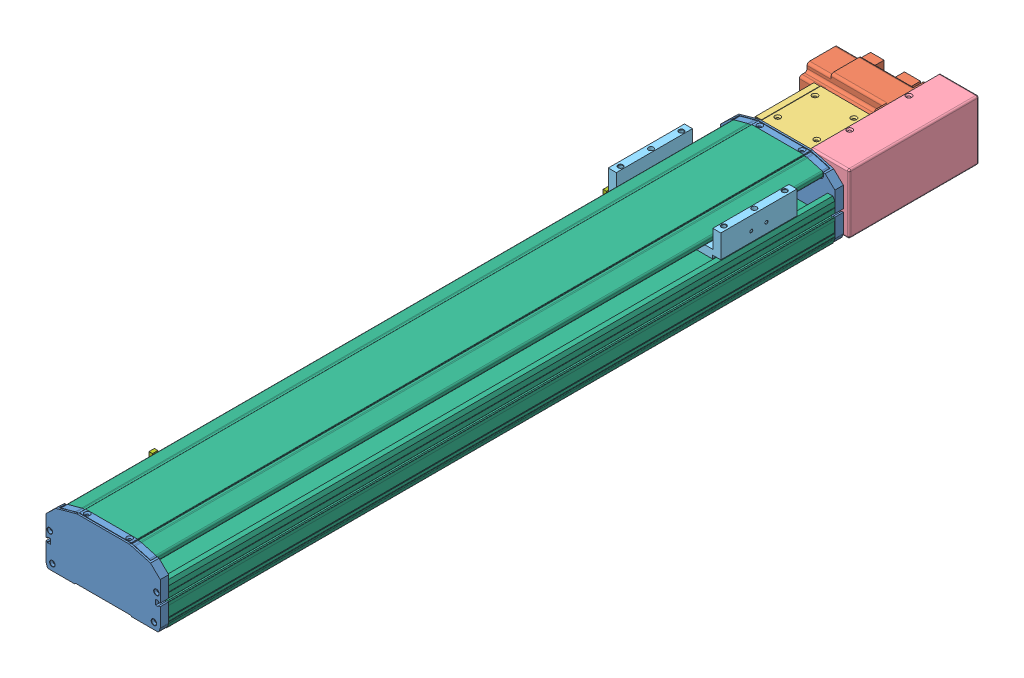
SolidWorks assembly TCD135-T-J3B-0.SLDASM, configuration 550 (file format 9000). Lengths in mm.
Overall size (155.15 78 965.8).
10 component instances, 7 part files, 28 mates.
Components (placement in the parent):
- TCD135-T-J3B-5-1: TCD135-T-J3B-5.SLDPRT [默认] at origin
- TCD135-T-J3B-3-1: TCD135-T-J3B-3.SLDPRT [默认] at (22.25 37.15 -111.8) x (0 0 1) z (-1 0 0)
- TCD135-T-J3B-4-1: TCD135-T-J3B-4.SLDPRT [默认] at (29.25 36.9 -35) x (0 1 0) z (-1 0 0)
- TCD135-T-J3B-6-1: TCD135-T-J3B-6.SLDPRT [默认] at (29.25 37.15 -76.75) x (0 0 1) z (1 0 0)
- TCD135-T-J3B-5-2: TCD135-T-J3B-5.SLDPRT [默认] at (0 0 807) x (-1 0 0) z (0 0 -1)
- TCD135-T-J3B-1-1: TCD135-T-J3B-1.sldprt [默认] at (0 33.9 98.7433)
- TCD135-T-J3B-2-2: TCD135-T-J3B-2.SLDPRT [550] at (0 0 10) x (-1 0 0) z (0 0 -1) size (135 73.5 787)
- TCD135-T-J3B-7-1: TCD135-T-J3B-7.sldprt [默认] at (-11 -5.2004 240.6996) x (-1 0 0) z (0 0 -1)
- TCD135-T-J3B-7-2: TCD135-T-J3B-7.sldprt [默认] at (-11 -5.2004 812.2996) x (-1 0 0) z (0 0 -1)
- TCD135-T-J3B-7-3: TCD135-T-J3B-7.sldprt [默认] at (-11 -5.2004 275.6996) x (-1 0 0) z (0 0 -1)
Mates (geometry in assembly coordinates):
- 重合1: coincident anti-aligned: plane of TCD135-T-J3B-3-1 through (29.25 10.15 -84.8) normal (1 0 0); plane of TCD135-T-J3B-6-1 through (29.25 37.15 -76.75) normal (-1 0 0)
- 距离1: distance = 11.7 mm aligned: plane of TCD135-T-J3B-3-1 through (-69.15 52.15 -141.8) normal (0 0 -1); plane of TCD135-T-J3B-6-1 through (74.25 72.4 -153.5) normal (0 0 -1)
- 距离2: distance = 5.25 mm aligned: plane of TCD135-T-J3B-3-1 through (-69.15 7.15 -126.8) normal (0 -1 0); plane of TCD135-T-J3B-6-1 through (74.25 1.9 -153.5) normal (0 -1 0)
- 重合2: coincident aligned: plane of TCD135-T-J3B-4-1 through (-29.25 1.9 0) normal (0 0 1); plane of TCD135-T-J3B-6-1 through (74.25 72.4 0) normal (0 0 1)
- 重合4: coincident anti-aligned: plane of TCD135-T-J3B-4-1 through (29.25 36.9 -35) normal (1 0 0); plane of TCD135-T-J3B-6-1 through (29.25 37.15 -76.75) normal (-1 0 0)
- 重合6: coincident anti-aligned: plane of TCD135-T-J3B-5-1 through (64.1333 0.9 0) normal (0 0 -1); plane of TCD135-T-J3B-4-1 through (-29.25 1.9 0) normal (0 0 1)
- 重合17: coincident aligned: plane of TCD135-T-J3B-4-1 through (-29.25 1.9 0) normal (0 -1 0); plane of TCD135-T-J3B-6-1 through (74.25 1.9 -153.5) normal (0 -1 0)
- LimitDistance1: limit distance = 123.7433 mm aligned: plane of TCD135-T-J3B-4-1 through (-29.25 1.9 -70) normal (0 0 -1); plane of TCD135-T-J3B-1-1 through (0 60.65 53.7433) normal (0 0 -1)
- LimitDistance2: limit distance = 663.2567 mm aligned: plane of TCD135-T-J3B-1-1 through (0 60.65 143.7433) normal (0 0 1); plane of TCD135-T-J3B-5-2 through (-64.1333 0.9 807) normal (0 0 1)
- 重合18: coincident anti-aligned: plane of TCD135-T-J3B-5-1 through (64.1333 0.9 10) normal (0 0 1); plane of TCD135-T-J3B-2-2 through (67.5 6 10) normal (0 0 -1)
- 重合19: coincident aligned: plane of TCD135-T-J3B-5-1 through (30.5 71.9 -105.7277) normal (0 1 0); plane of TCD135-T-J3B-2-2 through (-30.5 71.9 797) normal (0 1 0)
- 重合20: coincident aligned: plane of TCD135-T-J3B-5-1 through (-67.5 29.8 10) normal (-1 0 0); plane of TCD135-T-J3B-2-2 through (-67.5 22.5 797) normal (-1 0 0)
- 距离7: distance = 0.5 mm aligned: plane of TCD135-T-J3B-1-1 through (-66.5 62.65 98.7433) normal (-1 0 0); plane of TCD135-T-J3B-2-2 through (-67 10 797) normal (-1 0 0)
- 重合21: coincident aligned: plane of TCD135-T-J3B-5-2 through (-67.5 29.8 797) normal (-1 0 0); plane of TCD135-T-J3B-2-2 through (-67.5 30.1 797) normal (-1 0 0)
- 重合22: coincident aligned: plane of TCD135-T-J3B-5-2 through (-30.5 71.9 912.7277) normal (0 1 0); plane of TCD135-T-J3B-2-2 through (-30.5 71.9 797) normal (0 1 0)
- 重合23: coincident anti-aligned: plane of TCD135-T-J3B-5-2 through (-64.1333 0.9 797) normal (0 0 -1); plane of TCD135-T-J3B-2-2 through (67.5 6 797) normal (0 0 1)
- 距离8: distance = 78 mm anti-aligned: plane of TCD135-T-J3B-1-1 through (-61.75 76.4 98.7433) normal (0 1 0); plane of TCD135-T-J3B-2-2 through (-34.1 -1.6 797) normal (0 -1 0)
- 重合24: coincident aligned: plane of TCD135-T-J3B-4-1 through (-29.25 71.9 0) normal (0 1 0); plane of TCD135-T-J3B-2-2 through (-30.5 71.9 797) normal (0 1 0)
- 距离9: distance = 30.25 mm aligned: plane of TCD135-T-J3B-4-1 through (-37.25 36.9 -35) normal (-1 0 0); plane of TCD135-T-J3B-5-1 through (-67.5 29.8 10) normal (-1 0 0)
- 重合25: coincident anti-aligned: plane of TCD135-T-J3B-2-2 through (-67.5 30.1 797) normal (-1 0 0); plane of TCD135-T-J3B-7-1 through (-67.5 17 84.2) normal (1 0 0)
- 重合26: coincident aligned: plane of TCD135-T-J3B-2-2 through (-67.2 26.2 797) normal (0 1 0); plane of TCD135-T-J3B-7-1 through (-67.5 26.2 87.6633) normal (0 1 0)
- 重合27: coincident anti-aligned: plane of TCD135-T-J3B-2-2 through (-67.5 30.1 797) normal (-1 0 0); plane of TCD135-T-J3B-7-2 through (-67.5 17 655.8) normal (1 0 0)
- 重合28: coincident aligned: plane of TCD135-T-J3B-2-2 through (-67.2 26.2 797) normal (0 1 0); plane of TCD135-T-J3B-7-2 through (-67.5 26.2 659.2633) normal (0 1 0)
- 重合29: coincident anti-aligned: plane of TCD135-T-J3B-2-2 through (-67.5 30.1 797) normal (-1 0 0); plane of TCD135-T-J3B-7-3 through (-67.5 17 119.2) normal (1 0 0)
- 重合30: coincident aligned: plane of TCD135-T-J3B-2-2 through (-67.2 26.2 797) normal (0 1 0); plane of TCD135-T-J3B-7-3 through (-67.5 26.2 122.6633) normal (0 1 0)
- 距离10: distance = 35 mm aligned: plane of TCD135-T-J3B-7-1 through (-67.5 17 94) normal (0 0 -1); plane of TCD135-T-J3B-7-3 through (-67.5 17 129) normal (0 0 -1)
- 距离11: distance = 94 mm aligned: plane of TCD135-T-J3B-7-1 through (-67.5 17 94) normal (0 0 -1); plane of TCD135-T-J3B-5-1 through (64.1333 0.9 0) normal (0 0 -1)
- 距离12: distance = 135 mm aligned: plane of TCD135-T-J3B-7-2 through (-67.5 17 672) normal (0 0 1); plane of TCD135-T-J3B-5-2 through (-64.1333 0.9 807) normal (0 0 1)
